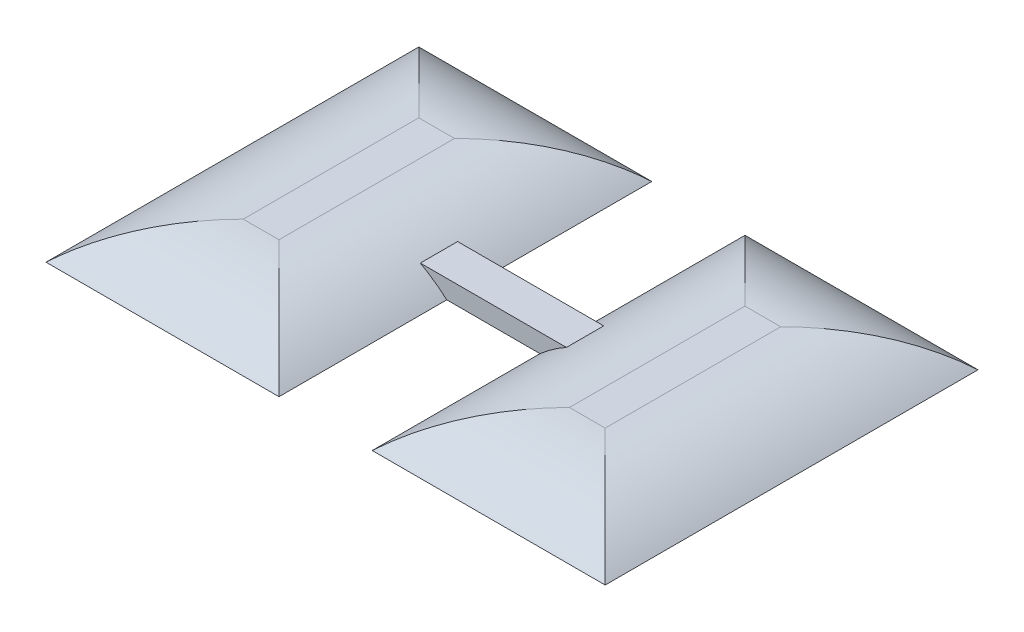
ISO-10303-21;
HEADER;
FILE_DESCRIPTION(('STEP AP214'),'2;1');
FILE_NAME('part.step','',(''),(''),'','','');
FILE_SCHEMA(('AUTOMOTIVE_DESIGN { 1 0 10303 214 1 1 1 1 }'));
ENDSEC;
DATA;
#1=APPLICATION_CONTEXT('core data for automotive mechanical design processes');
#2=APPLICATION_PROTOCOL_DEFINITION('international standard','automotive_design',2000,#1);
#3=PRODUCT_CONTEXT('',#1,'mechanical');
#4=PRODUCT('Part','Part','',(#3));
#5=PRODUCT_RELATED_PRODUCT_CATEGORY('part','',(#4));
#6=PRODUCT_DEFINITION_FORMATION('','',#4);
#7=PRODUCT_DEFINITION_CONTEXT('part definition',#1,'design');
#8=PRODUCT_DEFINITION('design','',#6,#7);
#9=PRODUCT_DEFINITION_SHAPE('','',#8);
#10=(LENGTH_UNIT() NAMED_UNIT(*) SI_UNIT(.MILLI.,.METRE.));
#11=(NAMED_UNIT(*) PLANE_ANGLE_UNIT() SI_UNIT($,.RADIAN.));
#12=(NAMED_UNIT(*) SI_UNIT($,.STERADIAN.) SOLID_ANGLE_UNIT());
#13=UNCERTAINTY_MEASURE_WITH_UNIT(LENGTH_MEASURE(1.E-05),#10,'distance_accuracy_value','');
#14=(GEOMETRIC_REPRESENTATION_CONTEXT(3) GLOBAL_UNCERTAINTY_ASSIGNED_CONTEXT((#13)) GLOBAL_UNIT_ASSIGNED_CONTEXT((#10,
#11,#12)) REPRESENTATION_CONTEXT('',''));
#15=CARTESIAN_POINT('',(0.,0.,0.));
#16=DIRECTION('',(0.,0.,1.));
#17=DIRECTION('',(1.,0.,0.));
#18=AXIS2_PLACEMENT_3D('',#15,#16,#17);
#19=CARTESIAN_POINT('',(-0.779150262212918,-0.6,-1.));
#20=DIRECTION('',(0.,0.,-1.));
#21=DIRECTION('',(-1.,0.,0.));
#22=AXIS2_PLACEMENT_3D('',#19,#20,#21);
#23=CYLINDRICAL_SURFACE('',#22,0.8);
#24=DIRECTION('',(0.,0.,-1.));
#25=VECTOR('',#24,1.);
#26=CARTESIAN_POINT('',(-0.25,0.,-1.));
#27=LINE('',#26,#25);
#28=CARTESIAN_POINT('',(-0.25,0.,1.));
#29=VERTEX_POINT('',#28);
#30=CARTESIAN_POINT('',(-0.25,0.,0.1));
#31=VERTEX_POINT('',#30);
#32=EDGE_CURVE('E178',#29,#31,#27,.T.);
#33=ORIENTED_EDGE('',*,*,#32,.T.);
#34=CARTESIAN_POINT('',(-0.779150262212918,-0.6,0.1));
#35=DIRECTION('',(0.,0.,-1.));
#36=DIRECTION('',(-1.,0.,0.));
#37=AXIS2_PLACEMENT_3D('',#34,#35,#36);
#38=CIRCLE('',#37,0.8);
#39=CARTESIAN_POINT('',(-0.391851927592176,0.1,0.1));
#40=VERTEX_POINT('',#39);
#41=EDGE_CURVE('E39',#31,#40,#38,.F.);
#42=ORIENTED_EDGE('',*,*,#41,.T.);
#43=DIRECTION('',(0.,0.,-1.));
#44=VECTOR('',#43,1.);
#45=CARTESIAN_POINT('',(-0.391851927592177,0.1,-1.));
#46=LINE('',#45,#44);
#47=CARTESIAN_POINT('',(-0.391851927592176,0.1,-0.0999999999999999));
#48=VERTEX_POINT('',#47);
#49=EDGE_CURVE('E192',#48,#40,#46,.F.);
#50=ORIENTED_EDGE('',*,*,#49,.F.);
#51=CARTESIAN_POINT('',(-0.779150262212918,-0.6,-0.1));
#52=DIRECTION('',(0.,0.,1.));
#53=DIRECTION('',(1.,0.,0.));
#54=AXIS2_PLACEMENT_3D('',#51,#52,#53);
#55=CIRCLE('',#54,0.8);
#56=CARTESIAN_POINT('',(-0.25,0.,-0.1));
#57=VERTEX_POINT('',#56);
#58=EDGE_CURVE('E203',#48,#57,#55,.F.);
#59=ORIENTED_EDGE('',*,*,#58,.T.);
#60=CARTESIAN_POINT('',(-0.25,0.,-1.));
#61=VERTEX_POINT('',#60);
#62=EDGE_CURVE('E177',#57,#61,#27,.T.);
#63=ORIENTED_EDGE('',*,*,#62,.T.);
#64=CARTESIAN_POINT('',(-0.779150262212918,-0.6,-0.470849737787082));
#65=DIRECTION('',(-0.707106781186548,0.,-0.707106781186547));
#66=DIRECTION('',(0.707106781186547,0.,-0.707106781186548));
#67=AXIS2_PLACEMENT_3D('',#64,#65,#66);
#68=ELLIPSE('',#67,1.13137084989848,0.8);
#69=CARTESIAN_POINT('',(-0.779150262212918,0.2,-0.470849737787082));
#70=VERTEX_POINT('',#69);
#71=EDGE_CURVE('E174',#70,#61,#68,.T.);
#72=ORIENTED_EDGE('',*,*,#71,.F.);
#73=DIRECTION('',(0.,0.,1.));
#74=VECTOR('',#73,1.);
#75=CARTESIAN_POINT('',(-0.779150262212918,0.2,-1.));
#76=LINE('',#75,#74);
#77=CARTESIAN_POINT('',(-0.779150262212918,0.2,0.470849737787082));
#78=VERTEX_POINT('',#77);
#79=EDGE_CURVE('E185',#78,#70,#76,.F.);
#80=ORIENTED_EDGE('',*,*,#79,.F.);
#81=CARTESIAN_POINT('',(-0.779150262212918,-0.6,0.470849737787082));
#82=DIRECTION('',(0.707106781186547,0.,-0.707106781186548));
#83=DIRECTION('',(0.707106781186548,0.,0.707106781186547));
#84=AXIS2_PLACEMENT_3D('',#81,#82,#83);
#85=ELLIPSE('',#84,1.13137084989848,0.8);
#86=EDGE_CURVE('E196',#29,#78,#85,.F.);
#87=ORIENTED_EDGE('',*,*,#86,.F.);
#88=EDGE_LOOP('',(#33,#42,#50,#59,#63,#72,#80,#87));
#89=FACE_BOUND('',#88,.T.);
#90=ADVANCED_FACE('F32',(#89),#23,.T.);
#91=CARTESIAN_POINT('',(0.,0.2,0.));
#92=DIRECTION('',(0.,1.,0.));
#93=DIRECTION('',(0.,0.,1.));
#94=AXIS2_PLACEMENT_3D('',#91,#92,#93);
#95=PLANE('',#94);
#96=DIRECTION('',(1.,0.,0.));
#97=VECTOR('',#96,1.);
#98=CARTESIAN_POINT('',(-1.5,0.2,-0.470849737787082));
#99=LINE('',#98,#97);
#100=CARTESIAN_POINT('',(-0.970849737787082,0.2,-0.470849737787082));
#101=VERTEX_POINT('',#100);
#102=EDGE_CURVE('E187',#70,#101,#99,.F.);
#103=ORIENTED_EDGE('',*,*,#102,.T.);
#104=DIRECTION('',(0.,0.,-1.));
#105=VECTOR('',#104,1.);
#106=CARTESIAN_POINT('',(-0.970849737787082,0.2,1.));
#107=LINE('',#106,#105);
#108=CARTESIAN_POINT('',(-0.970849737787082,0.2,0.470849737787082));
#109=VERTEX_POINT('',#108);
#110=EDGE_CURVE('E189',#101,#109,#107,.F.);
#111=ORIENTED_EDGE('',*,*,#110,.T.);
#112=DIRECTION('',(-1.,0.,0.));
#113=VECTOR('',#112,1.);
#114=CARTESIAN_POINT('',(-0.25,0.2,0.470849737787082));
#115=LINE('',#114,#113);
#116=EDGE_CURVE('E183',#109,#78,#115,.F.);
#117=ORIENTED_EDGE('',*,*,#116,.T.);
#118=ORIENTED_EDGE('',*,*,#79,.T.);
#119=EDGE_LOOP('',(#103,#111,#117,#118));
#120=FACE_BOUND('',#119,.T.);
#121=ADVANCED_FACE('F228',(#120),#95,.T.);
#122=CARTESIAN_POINT('',(0.,0.,0.));
#123=DIRECTION('',(0.,1.,0.));
#124=DIRECTION('',(0.,0.,1.));
#125=AXIS2_PLACEMENT_3D('',#122,#123,#124);
#126=PLANE('',#125);
#127=DIRECTION('',(-1.,0.,0.));
#128=VECTOR('',#127,1.);
#129=CARTESIAN_POINT('',(-0.5,0.,-0.1));
#130=LINE('',#129,#128);
#131=CARTESIAN_POINT('',(0.25,0.,-0.1));
#132=VERTEX_POINT('',#131);
#133=EDGE_CURVE('E165',#132,#57,#130,.T.);
#134=ORIENTED_EDGE('',*,*,#133,.F.);
#135=DIRECTION('',(0.,0.,1.));
#136=VECTOR('',#135,1.);
#137=CARTESIAN_POINT('',(0.25,0.,-1.));
#138=LINE('',#137,#136);
#139=CARTESIAN_POINT('',(0.25,0.,-1.));
#140=VERTEX_POINT('',#139);
#141=EDGE_CURVE('E129',#140,#132,#138,.T.);
#142=ORIENTED_EDGE('',*,*,#141,.F.);
#143=DIRECTION('',(-1.,0.,0.));
#144=VECTOR('',#143,1.);
#145=CARTESIAN_POINT('',(1.5,0.,-1.));
#146=LINE('',#145,#144);
#147=CARTESIAN_POINT('',(1.5,0.,-1.));
#148=VERTEX_POINT('',#147);
#149=EDGE_CURVE('E123',#148,#140,#146,.T.);
#150=ORIENTED_EDGE('',*,*,#149,.F.);
#151=DIRECTION('',(0.,0.,-1.));
#152=VECTOR('',#151,1.);
#153=CARTESIAN_POINT('',(1.5,0.,-1.));
#154=LINE('',#153,#152);
#155=CARTESIAN_POINT('',(1.5,0.,1.));
#156=VERTEX_POINT('',#155);
#157=EDGE_CURVE('E127',#156,#148,#154,.T.);
#158=ORIENTED_EDGE('',*,*,#157,.F.);
#159=DIRECTION('',(1.,0.,0.));
#160=VECTOR('',#159,1.);
#161=CARTESIAN_POINT('',(1.5,0.,1.));
#162=LINE('',#161,#160);
#163=CARTESIAN_POINT('',(0.25,0.,1.));
#164=VERTEX_POINT('',#163);
#165=EDGE_CURVE('E277',#164,#156,#162,.T.);
#166=ORIENTED_EDGE('',*,*,#165,.F.);
#167=CARTESIAN_POINT('',(0.25,0.,0.1));
#168=VERTEX_POINT('',#167);
#169=EDGE_CURVE('E134',#168,#164,#138,.T.);
#170=ORIENTED_EDGE('',*,*,#169,.F.);
#171=DIRECTION('',(1.,0.,0.));
#172=VECTOR('',#171,1.);
#173=CARTESIAN_POINT('',(-0.5,0.,0.1));
#174=LINE('',#173,#172);
#175=EDGE_CURVE('E46',#31,#168,#174,.T.);
#176=ORIENTED_EDGE('',*,*,#175,.F.);
#177=ORIENTED_EDGE('',*,*,#32,.F.);
#178=DIRECTION('',(1.,0.,0.));
#179=VECTOR('',#178,1.);
#180=CARTESIAN_POINT('',(-1.5,0.,1.));
#181=LINE('',#180,#179);
#182=CARTESIAN_POINT('',(-1.5,0.,1.));
#183=VERTEX_POINT('',#182);
#184=EDGE_CURVE('E173',#183,#29,#181,.T.);
#185=ORIENTED_EDGE('',*,*,#184,.F.);
#186=DIRECTION('',(0.,0.,1.));
#187=VECTOR('',#186,1.);
#188=CARTESIAN_POINT('',(-1.5,0.,-1.));
#189=LINE('',#188,#187);
#190=CARTESIAN_POINT('',(-1.5,0.,-1.));
#191=VERTEX_POINT('',#190);
#192=EDGE_CURVE('E170',#191,#183,#189,.T.);
#193=ORIENTED_EDGE('',*,*,#192,.F.);
#194=DIRECTION('',(-1.,0.,0.));
#195=VECTOR('',#194,1.);
#196=CARTESIAN_POINT('',(-1.5,0.,-1.));
#197=LINE('',#196,#195);
#198=EDGE_CURVE('E180',#61,#191,#197,.T.);
#199=ORIENTED_EDGE('',*,*,#198,.F.);
#200=ORIENTED_EDGE('',*,*,#62,.F.);
#201=EDGE_LOOP('',(#134,#142,#150,#158,#166,#170,#176,#177,#185,#193,#199,#200));
#202=FACE_BOUND('',#201,.T.);
#203=ADVANCED_FACE('F125',(#202),#126,.F.);
#204=CARTESIAN_POINT('',(-1.5,-0.6,-0.470849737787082));
#205=DIRECTION('',(-1.,0.,0.));
#206=DIRECTION('',(0.,0.,1.));
#207=AXIS2_PLACEMENT_3D('',#204,#205,#206);
#208=CYLINDRICAL_SURFACE('',#207,0.8);
#209=ORIENTED_EDGE('',*,*,#71,.T.);
#210=ORIENTED_EDGE('',*,*,#198,.T.);
#211=CARTESIAN_POINT('',(-0.970849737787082,-0.6,-0.470849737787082));
#212=DIRECTION('',(-0.707106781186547,0.,0.707106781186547));
#213=DIRECTION('',(-0.707106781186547,0.,-0.707106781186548));
#214=AXIS2_PLACEMENT_3D('',#211,#212,#213);
#215=ELLIPSE('',#214,1.13137084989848,0.8);
#216=EDGE_CURVE('E194',#101,#191,#215,.T.);
#217=ORIENTED_EDGE('',*,*,#216,.F.);
#218=ORIENTED_EDGE('',*,*,#102,.F.);
#219=EDGE_LOOP('',(#209,#210,#217,#218));
#220=FACE_BOUND('',#219,.T.);
#221=ADVANCED_FACE('F225',(#220),#208,.T.);
#222=CARTESIAN_POINT('',(-1.5,-0.6,0.470849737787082));
#223=DIRECTION('',(1.,0.,0.));
#224=DIRECTION('',(0.,0.,-1.));
#225=AXIS2_PLACEMENT_3D('',#222,#223,#224);
#226=CYLINDRICAL_SURFACE('',#225,0.8);
#227=ORIENTED_EDGE('',*,*,#86,.T.);
#228=ORIENTED_EDGE('',*,*,#116,.F.);
#229=CARTESIAN_POINT('',(-0.970849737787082,-0.6,0.470849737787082));
#230=DIRECTION('',(0.707106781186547,0.,0.707106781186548));
#231=DIRECTION('',(0.707106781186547,0.,-0.707106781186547));
#232=AXIS2_PLACEMENT_3D('',#229,#230,#231);
#233=ELLIPSE('',#232,1.13137084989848,0.8);
#234=EDGE_CURVE('E167',#183,#109,#233,.F.);
#235=ORIENTED_EDGE('',*,*,#234,.F.);
#236=ORIENTED_EDGE('',*,*,#184,.T.);
#237=EDGE_LOOP('',(#227,#228,#235,#236));
#238=FACE_BOUND('',#237,.T.);
#239=ADVANCED_FACE('F231',(#238),#226,.T.);
#240=CARTESIAN_POINT('',(-0.970849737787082,-0.6,-1.));
#241=DIRECTION('',(0.,0.,1.));
#242=DIRECTION('',(1.,0.,0.));
#243=AXIS2_PLACEMENT_3D('',#240,#241,#242);
#244=CYLINDRICAL_SURFACE('',#243,0.8);
#245=ORIENTED_EDGE('',*,*,#216,.T.);
#246=ORIENTED_EDGE('',*,*,#192,.T.);
#247=ORIENTED_EDGE('',*,*,#234,.T.);
#248=ORIENTED_EDGE('',*,*,#110,.F.);
#249=EDGE_LOOP('',(#245,#246,#247,#248));
#250=FACE_BOUND('',#249,.T.);
#251=ADVANCED_FACE('F234',(#250),#244,.T.);
#252=CARTESIAN_POINT('',(-0.5,0.1,0.1));
#253=DIRECTION('',(0.,0.,-1.));
#254=DIRECTION('',(-1.,0.,0.));
#255=AXIS2_PLACEMENT_3D('',#252,#253,#254);
#256=PLANE('',#255);
#257=ORIENTED_EDGE('',*,*,#175,.T.);
#258=CARTESIAN_POINT('',(0.779150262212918,-0.6,0.1));
#259=DIRECTION('',(0.,0.,-1.));
#260=DIRECTION('',(-1.,0.,0.));
#261=AXIS2_PLACEMENT_3D('',#258,#259,#260);
#262=CIRCLE('',#261,0.8);
#263=CARTESIAN_POINT('',(0.391851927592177,0.1,0.1));
#264=VERTEX_POINT('',#263);
#265=EDGE_CURVE('E160',#168,#264,#262,.T.);
#266=ORIENTED_EDGE('',*,*,#265,.T.);
#267=DIRECTION('',(1.,0.,0.));
#268=VECTOR('',#267,1.);
#269=CARTESIAN_POINT('',(-0.5,0.1,0.1));
#270=LINE('',#269,#268);
#271=EDGE_CURVE('E162',#40,#264,#270,.T.);
#272=ORIENTED_EDGE('',*,*,#271,.F.);
#273=ORIENTED_EDGE('',*,*,#41,.F.);
#274=EDGE_LOOP('',(#257,#266,#272,#273));
#275=FACE_BOUND('',#274,.T.);
#276=ADVANCED_FACE('F212',(#275),#256,.F.);
#277=CARTESIAN_POINT('',(-0.5,0.1,-0.1));
#278=DIRECTION('',(0.,0.,1.));
#279=DIRECTION('',(1.,0.,0.));
#280=AXIS2_PLACEMENT_3D('',#277,#278,#279);
#281=PLANE('',#280);
#282=DIRECTION('',(-1.,0.,0.));
#283=VECTOR('',#282,1.);
#284=CARTESIAN_POINT('',(-0.5,0.1,-0.1));
#285=LINE('',#284,#283);
#286=CARTESIAN_POINT('',(0.391851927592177,0.1,-0.1));
#287=VERTEX_POINT('',#286);
#288=EDGE_CURVE('E164',#287,#48,#285,.T.);
#289=ORIENTED_EDGE('',*,*,#288,.F.);
#290=CARTESIAN_POINT('',(0.779150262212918,-0.6,-0.0999999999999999));
#291=DIRECTION('',(0.,0.,1.));
#292=DIRECTION('',(1.,0.,0.));
#293=AXIS2_PLACEMENT_3D('',#290,#291,#292);
#294=CIRCLE('',#293,0.8);
#295=EDGE_CURVE('E54',#287,#132,#294,.T.);
#296=ORIENTED_EDGE('',*,*,#295,.T.);
#297=ORIENTED_EDGE('',*,*,#133,.T.);
#298=ORIENTED_EDGE('',*,*,#58,.F.);
#299=EDGE_LOOP('',(#289,#296,#297,#298));
#300=FACE_BOUND('',#299,.T.);
#301=ADVANCED_FACE('F216',(#300),#281,.F.);
#302=CARTESIAN_POINT('',(0.,0.1,0.));
#303=DIRECTION('',(0.,1.,0.));
#304=DIRECTION('',(0.,0.,1.));
#305=AXIS2_PLACEMENT_3D('',#302,#303,#304);
#306=PLANE('',#305);
#307=DIRECTION('',(0.,0.,-1.));
#308=VECTOR('',#307,1.);
#309=CARTESIAN_POINT('',(0.391851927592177,0.1,-1.));
#310=LINE('',#309,#308);
#311=EDGE_CURVE('E11',#287,#264,#310,.F.);
#312=ORIENTED_EDGE('',*,*,#311,.F.);
#313=ORIENTED_EDGE('',*,*,#288,.T.);
#314=ORIENTED_EDGE('',*,*,#49,.T.);
#315=ORIENTED_EDGE('',*,*,#271,.T.);
#316=EDGE_LOOP('',(#312,#313,#314,#315));
#317=FACE_BOUND('',#316,.T.);
#318=ADVANCED_FACE('F211',(#317),#306,.T.);
#319=CARTESIAN_POINT('',(0.779150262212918,-0.6,-1.));
#320=DIRECTION('',(0.,0.,-1.));
#321=DIRECTION('',(-1.,0.,0.));
#322=AXIS2_PLACEMENT_3D('',#319,#320,#321);
#323=CYLINDRICAL_SURFACE('',#322,0.8);
#324=ORIENTED_EDGE('',*,*,#265,.F.);
#325=ORIENTED_EDGE('',*,*,#169,.T.);
#326=CARTESIAN_POINT('',(0.779150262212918,-0.6,0.470849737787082));
#327=DIRECTION('',(-0.707106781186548,0.,-0.707106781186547));
#328=DIRECTION('',(-0.707106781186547,0.,0.707106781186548));
#329=AXIS2_PLACEMENT_3D('',#326,#327,#328);
#330=ELLIPSE('',#329,1.13137084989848,0.8);
#331=CARTESIAN_POINT('',(0.779150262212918,0.2,0.470849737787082));
#332=VERTEX_POINT('',#331);
#333=EDGE_CURVE('E144',#332,#164,#330,.F.);
#334=ORIENTED_EDGE('',*,*,#333,.F.);
#335=DIRECTION('',(0.,0.,-1.));
#336=VECTOR('',#335,1.);
#337=CARTESIAN_POINT('',(0.779150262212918,0.2,0.));
#338=LINE('',#337,#336);
#339=CARTESIAN_POINT('',(0.779150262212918,0.2,-0.470849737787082));
#340=VERTEX_POINT('',#339);
#341=EDGE_CURVE('E275',#340,#332,#338,.F.);
#342=ORIENTED_EDGE('',*,*,#341,.F.);
#343=CARTESIAN_POINT('',(0.779150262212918,-0.6,-0.470849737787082));
#344=DIRECTION('',(0.707106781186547,0.,-0.707106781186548));
#345=DIRECTION('',(-0.707106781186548,0.,-0.707106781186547));
#346=AXIS2_PLACEMENT_3D('',#343,#344,#345);
#347=ELLIPSE('',#346,1.13137084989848,0.8);
#348=EDGE_CURVE('E150',#140,#340,#347,.T.);
#349=ORIENTED_EDGE('',*,*,#348,.F.);
#350=ORIENTED_EDGE('',*,*,#141,.T.);
#351=ORIENTED_EDGE('',*,*,#295,.F.);
#352=ORIENTED_EDGE('',*,*,#311,.T.);
#353=EDGE_LOOP('',(#324,#325,#334,#342,#349,#350,#351,#352));
#354=FACE_BOUND('',#353,.T.);
#355=ADVANCED_FACE('F215',(#354),#323,.T.);
#356=CARTESIAN_POINT('',(0.,0.2,0.));
#357=DIRECTION('',(0.,-1.,0.));
#358=DIRECTION('',(0.,0.,-1.));
#359=AXIS2_PLACEMENT_3D('',#356,#357,#358);
#360=PLANE('',#359);
#361=DIRECTION('',(-1.,0.,0.));
#362=VECTOR('',#361,1.);
#363=CARTESIAN_POINT('',(0.,0.2,0.470849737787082));
#364=LINE('',#363,#362);
#365=CARTESIAN_POINT('',(0.970849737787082,0.2,0.470849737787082));
#366=VERTEX_POINT('',#365);
#367=EDGE_CURVE('E273',#332,#366,#364,.F.);
#368=ORIENTED_EDGE('',*,*,#367,.T.);
#369=DIRECTION('',(0.,0.,1.));
#370=VECTOR('',#369,1.);
#371=CARTESIAN_POINT('',(0.970849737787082,0.2,0.));
#372=LINE('',#371,#370);
#373=CARTESIAN_POINT('',(0.970849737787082,0.2,-0.470849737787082));
#374=VERTEX_POINT('',#373);
#375=EDGE_CURVE('E153',#366,#374,#372,.F.);
#376=ORIENTED_EDGE('',*,*,#375,.T.);
#377=DIRECTION('',(1.,0.,0.));
#378=VECTOR('',#377,1.);
#379=CARTESIAN_POINT('',(0.,0.2,-0.470849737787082));
#380=LINE('',#379,#378);
#381=EDGE_CURVE('E147',#374,#340,#380,.F.);
#382=ORIENTED_EDGE('',*,*,#381,.T.);
#383=ORIENTED_EDGE('',*,*,#341,.T.);
#384=EDGE_LOOP('',(#368,#376,#382,#383));
#385=FACE_BOUND('',#384,.T.);
#386=ADVANCED_FACE('F259',(#385),#360,.F.);
#387=CARTESIAN_POINT('',(1.5,-0.6,0.470849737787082));
#388=DIRECTION('',(-1.,0.,0.));
#389=DIRECTION('',(0.,0.,1.));
#390=AXIS2_PLACEMENT_3D('',#387,#388,#389);
#391=CYLINDRICAL_SURFACE('',#390,0.8);
#392=ORIENTED_EDGE('',*,*,#333,.T.);
#393=ORIENTED_EDGE('',*,*,#165,.T.);
#394=CARTESIAN_POINT('',(0.970849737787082,-0.6,0.470849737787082));
#395=DIRECTION('',(-0.707106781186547,0.,0.707106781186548));
#396=DIRECTION('',(-0.707106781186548,0.,-0.707106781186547));
#397=AXIS2_PLACEMENT_3D('',#394,#395,#396);
#398=ELLIPSE('',#397,1.13137084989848,0.8);
#399=EDGE_CURVE('E142',#366,#156,#398,.F.);
#400=ORIENTED_EDGE('',*,*,#399,.F.);
#401=ORIENTED_EDGE('',*,*,#367,.F.);
#402=EDGE_LOOP('',(#392,#393,#400,#401));
#403=FACE_BOUND('',#402,.T.);
#404=ADVANCED_FACE('F260',(#403),#391,.T.);
#405=CARTESIAN_POINT('',(1.5,-0.6,-0.470849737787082));
#406=DIRECTION('',(1.,0.,0.));
#407=DIRECTION('',(0.,0.,-1.));
#408=AXIS2_PLACEMENT_3D('',#405,#406,#407);
#409=CYLINDRICAL_SURFACE('',#408,0.8);
#410=ORIENTED_EDGE('',*,*,#348,.T.);
#411=ORIENTED_EDGE('',*,*,#381,.F.);
#412=CARTESIAN_POINT('',(0.970849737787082,-0.6,-0.470849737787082));
#413=DIRECTION('',(0.707106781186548,0.,0.707106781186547));
#414=DIRECTION('',(0.707106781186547,0.,-0.707106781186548));
#415=AXIS2_PLACEMENT_3D('',#412,#413,#414);
#416=ELLIPSE('',#415,1.13137084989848,0.8);
#417=EDGE_CURVE('E139',#148,#374,#416,.T.);
#418=ORIENTED_EDGE('',*,*,#417,.F.);
#419=ORIENTED_EDGE('',*,*,#149,.T.);
#420=EDGE_LOOP('',(#410,#411,#418,#419));
#421=FACE_BOUND('',#420,.T.);
#422=ADVANCED_FACE('F146',(#421),#409,.T.);
#423=CARTESIAN_POINT('',(0.970849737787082,-0.6,-1.));
#424=DIRECTION('',(0.,0.,1.));
#425=DIRECTION('',(1.,0.,0.));
#426=AXIS2_PLACEMENT_3D('',#423,#424,#425);
#427=CYLINDRICAL_SURFACE('',#426,0.8);
#428=ORIENTED_EDGE('',*,*,#399,.T.);
#429=ORIENTED_EDGE('',*,*,#157,.T.);
#430=ORIENTED_EDGE('',*,*,#417,.T.);
#431=ORIENTED_EDGE('',*,*,#375,.F.);
#432=EDGE_LOOP('',(#428,#429,#430,#431));
#433=FACE_BOUND('',#432,.T.);
#434=ADVANCED_FACE('F137',(#433),#427,.T.);
#435=CLOSED_SHELL('',(#90,#121,#203,#221,#239,#251,#276,#301,#318,#355,#386,#404,#422,#434));
#436=MANIFOLD_SOLID_BREP('B2',#435);
#437=ADVANCED_BREP_SHAPE_REPRESENTATION('',(#18,#436),#14);
#438=SHAPE_DEFINITION_REPRESENTATION(#9,#437);
ENDSEC;
END-ISO-10303-21;
